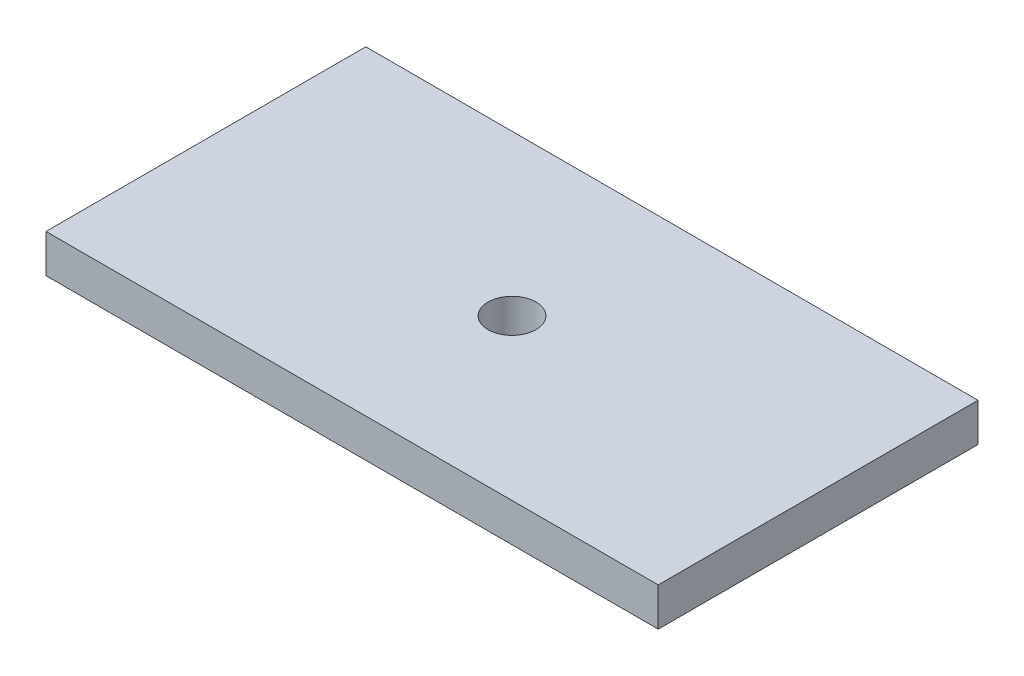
from build123d import *

# Parameters (mm, degrees)
SKETCH1_W           = 121.575555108
SKETCH1_H           = 63.5
SKETCH1_R           = 4.7625
BOSS_EXTRUDE1_DEPTH = 7.62


with BuildPart() as part:
    # Sketch1 → Boss-Extrude1 (new body)
    with BuildSketch(Plane(origin=(0, 0, 0), x_dir=(1, 0, 0), z_dir=(0, 1, 0))):
        Rectangle(SKETCH1_W, SKETCH1_H)
        with Locations(Location((0, 0, 0), (0, 0, 270))):
            Circle(SKETCH1_R, mode=Mode.SUBTRACT)
    extrude(amount=BOSS_EXTRUDE1_DEPTH)


solid = part.part
